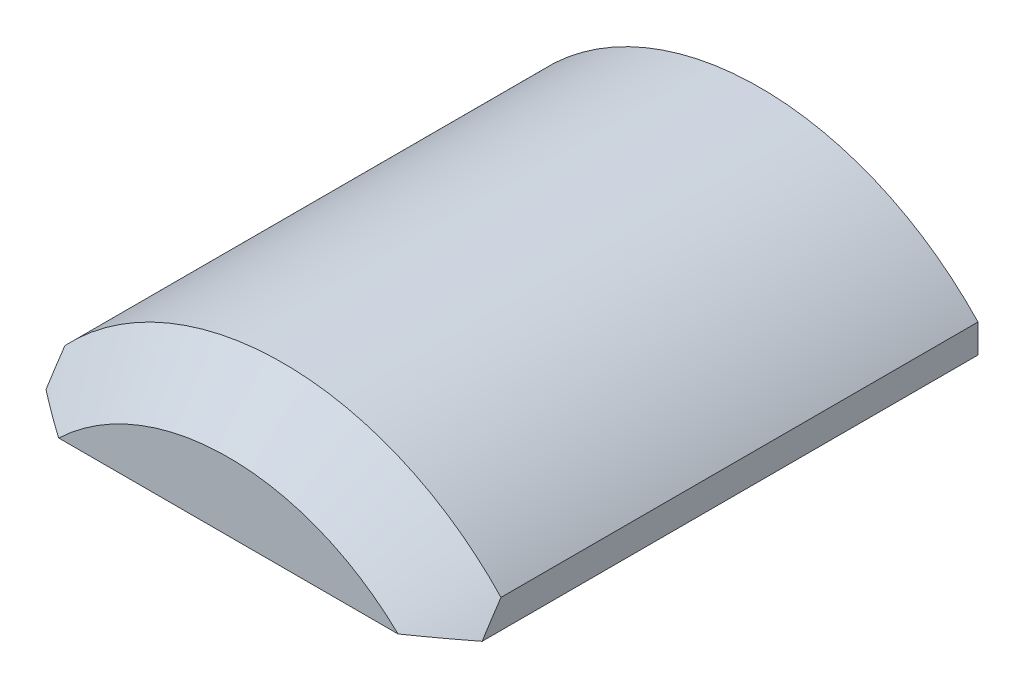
ISO-10303-21;
HEADER;
FILE_DESCRIPTION(('STEP AP214'),'2;1');
FILE_NAME('part.step','',(''),(''),'','','');
FILE_SCHEMA(('AUTOMOTIVE_DESIGN { 1 0 10303 214 1 1 1 1 }'));
ENDSEC;
DATA;
#1=APPLICATION_CONTEXT('core data for automotive mechanical design processes');
#2=APPLICATION_PROTOCOL_DEFINITION('international standard','automotive_design',2000,#1);
#3=PRODUCT_CONTEXT('',#1,'mechanical');
#4=PRODUCT('Part','Part','',(#3));
#5=PRODUCT_RELATED_PRODUCT_CATEGORY('part','',(#4));
#6=PRODUCT_DEFINITION_FORMATION('','',#4);
#7=PRODUCT_DEFINITION_CONTEXT('part definition',#1,'design');
#8=PRODUCT_DEFINITION('design','',#6,#7);
#9=PRODUCT_DEFINITION_SHAPE('','',#8);
#10=(LENGTH_UNIT() NAMED_UNIT(*) SI_UNIT(.MILLI.,.METRE.));
#11=(NAMED_UNIT(*) PLANE_ANGLE_UNIT() SI_UNIT($,.RADIAN.));
#12=(NAMED_UNIT(*) SI_UNIT($,.STERADIAN.) SOLID_ANGLE_UNIT());
#13=UNCERTAINTY_MEASURE_WITH_UNIT(LENGTH_MEASURE(1.E-05),#10,'distance_accuracy_value','');
#14=(GEOMETRIC_REPRESENTATION_CONTEXT(3) GLOBAL_UNCERTAINTY_ASSIGNED_CONTEXT((#13)) GLOBAL_UNIT_ASSIGNED_CONTEXT((#10,
#11,#12)) REPRESENTATION_CONTEXT('',''));
#15=CARTESIAN_POINT('',(0.,0.,0.));
#16=DIRECTION('',(0.,0.,1.));
#17=DIRECTION('',(1.,0.,0.));
#18=AXIS2_PLACEMENT_3D('',#15,#16,#17);
#19=CARTESIAN_POINT('',(0.,0.,247.65));
#20=DIRECTION('',(0.,0.,-1.));
#21=DIRECTION('',(-1.,0.,0.));
#22=AXIS2_PLACEMENT_3D('',#19,#20,#21);
#23=CYLINDRICAL_SURFACE('',#22,139.7);
#24=DIRECTION('',(0.,0.,-1.));
#25=VECTOR('',#24,1.);
#26=CARTESIAN_POINT('',(-101.6,95.8828973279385,247.65));
#27=LINE('',#26,#25);
#28=CARTESIAN_POINT('',(-101.6,95.8828973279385,222.25));
#29=VERTEX_POINT('',#28);
#30=CARTESIAN_POINT('',(-101.6,95.8828973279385,0.));
#31=VERTEX_POINT('',#30);
#32=EDGE_CURVE('E84',#29,#31,#27,.T.);
#33=ORIENTED_EDGE('',*,*,#32,.F.);
#34=CARTESIAN_POINT('',(0.,0.,222.25));
#35=DIRECTION('',(0.,0.,1.));
#36=DIRECTION('',(1.,0.,0.));
#37=AXIS2_PLACEMENT_3D('',#34,#35,#36);
#38=CIRCLE('',#37,139.7);
#39=CARTESIAN_POINT('',(101.6,95.8828973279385,222.25));
#40=VERTEX_POINT('',#39);
#41=EDGE_CURVE('E48',#29,#40,#38,.F.);
#42=ORIENTED_EDGE('',*,*,#41,.T.);
#43=DIRECTION('',(0.,0.,-1.));
#44=VECTOR('',#43,1.);
#45=CARTESIAN_POINT('',(101.6,95.8828973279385,247.65));
#46=LINE('',#45,#44);
#47=CARTESIAN_POINT('',(101.6,95.8828973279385,0.));
#48=VERTEX_POINT('',#47);
#49=EDGE_CURVE('E101',#40,#48,#46,.T.);
#50=ORIENTED_EDGE('',*,*,#49,.T.);
#51=CARTESIAN_POINT('',(0.,0.,0.));
#52=DIRECTION('',(0.,0.,1.));
#53=DIRECTION('',(1.,0.,0.));
#54=AXIS2_PLACEMENT_3D('',#51,#52,#53);
#55=CIRCLE('',#54,139.7);
#56=EDGE_CURVE('E97',#48,#31,#55,.T.);
#57=ORIENTED_EDGE('',*,*,#56,.T.);
#58=EDGE_LOOP('',(#33,#42,#50,#57));
#59=FACE_BOUND('',#58,.T.);
#60=ADVANCED_FACE('F35',(#59),#23,.T.);
#61=CARTESIAN_POINT('',(-101.6,82.55,247.65));
#62=DIRECTION('',(1.,0.,0.));
#63=DIRECTION('',(0.,1.,0.));
#64=AXIS2_PLACEMENT_3D('',#61,#62,#63);
#65=PLANE('',#64);
#66=DIRECTION('',(0.,0.,-1.));
#67=VECTOR('',#66,1.);
#68=CARTESIAN_POINT('',(-101.6,82.55,247.65));
#69=LINE('',#68,#67);
#70=CARTESIAN_POINT('',(-101.6,82.55,231.041396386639));
#71=VERTEX_POINT('',#70);
#72=CARTESIAN_POINT('',(-101.6,82.55,0.));
#73=VERTEX_POINT('',#72);
#74=EDGE_CURVE('E91',#71,#73,#69,.T.);
#75=ORIENTED_EDGE('',*,*,#74,.F.);
#76=CARTESIAN_POINT('',(-101.6,82.55,231.041396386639));
#77=CARTESIAN_POINT('',(-101.6,83.6758641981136,230.331419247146));
#78=CARTESIAN_POINT('',(-101.6,84.797786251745,229.615210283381));
#79=CARTESIAN_POINT('',(-101.6,87.0340324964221,228.171253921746));
#80=CARTESIAN_POINT('',(-101.6,88.1483573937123,227.443507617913));
#81=CARTESIAN_POINT('',(-101.6,90.3698975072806,225.977274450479));
#82=CARTESIAN_POINT('',(-101.6,91.4771127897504,225.238787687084));
#83=CARTESIAN_POINT('',(-101.6,93.6849132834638,223.751743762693));
#84=CARTESIAN_POINT('',(-101.6,94.7854978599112,223.00318565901));
#85=CARTESIAN_POINT('',(-101.6,95.8828973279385,222.25));
#86=B_SPLINE_CURVE_WITH_KNOTS('',3,(#76,#77,#78,#79,#80,#81,#82,#83,#84,#85),.UNSPECIFIED.,.F.,
.F.,(4,2,2,2,4),(0.,3.99305105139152,7.98572569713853,11.9783631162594,15.9713768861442),.UNSPECIFIED.);
#87=EDGE_CURVE('E62',#71,#29,#86,.T.);
#88=ORIENTED_EDGE('',*,*,#87,.T.);
#89=ORIENTED_EDGE('',*,*,#32,.T.);
#90=DIRECTION('',(0.,-1.,0.));
#91=VECTOR('',#90,1.);
#92=CARTESIAN_POINT('',(-101.6,82.55,0.));
#93=LINE('',#92,#91);
#94=EDGE_CURVE('E87',#31,#73,#93,.T.);
#95=ORIENTED_EDGE('',*,*,#94,.T.);
#96=EDGE_LOOP('',(#75,#88,#89,#95));
#97=FACE_BOUND('',#96,.T.);
#98=ADVANCED_FACE('F86',(#97),#65,.F.);
#99=CARTESIAN_POINT('',(101.6,82.55,247.65));
#100=DIRECTION('',(0.,1.,0.));
#101=DIRECTION('',(-1.,0.,0.));
#102=AXIS2_PLACEMENT_3D('',#99,#100,#101);
#103=PLANE('',#102);
#104=DIRECTION('',(1.,0.,0.));
#105=VECTOR('',#104,1.);
#106=CARTESIAN_POINT('',(101.6,82.55,247.65));
#107=LINE('',#106,#105);
#108=CARTESIAN_POINT('',(-79.0568624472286,82.55,247.65));
#109=VERTEX_POINT('',#108);
#110=CARTESIAN_POINT('',(79.0568624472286,82.55,247.65));
#111=VERTEX_POINT('',#110);
#112=EDGE_CURVE('E105',#109,#111,#107,.T.);
#113=ORIENTED_EDGE('',*,*,#112,.F.);
#114=CARTESIAN_POINT('',(-79.0568624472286,82.55,247.65));
#115=CARTESIAN_POINT('',(-80.0166359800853,82.55,246.986152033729));
#116=CARTESIAN_POINT('',(-80.9734615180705,82.55,246.318058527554));
#117=CARTESIAN_POINT('',(-82.8815320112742,82.55,244.973968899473));
#118=CARTESIAN_POINT('',(-83.8327770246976,82.55,244.297972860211));
#119=CARTESIAN_POINT('',(-86.6782846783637,82.55,242.259250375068));
#120=CARTESIAN_POINT('',(-88.5646835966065,82.55,240.885537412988));
#121=CARTESIAN_POINT('',(-92.318680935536,82.55,238.112846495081));
#122=CARTESIAN_POINT('',(-94.1862800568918,82.55,236.713869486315));
#123=CARTESIAN_POINT('',(-96.9752948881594,82.55,234.598739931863));
#124=CARTESIAN_POINT('',(-97.9029912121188,82.55,233.890850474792));
#125=CARTESIAN_POINT('',(-99.7544148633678,82.55,232.46990945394));
#126=CARTESIAN_POINT('',(-100.678142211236,82.55,231.756857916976));
#127=CARTESIAN_POINT('',(-101.6,82.55,231.041396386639));
#128=B_SPLINE_CURVE_WITH_KNOTS('',3,(#114,#115,#116,#117,#118,#119,#120,#121,#122,#123,#124,
#125,#126,#127),.UNSPECIFIED.,.F.,.F.,(4,2,2,2,2,2,4),(0.,3.50093489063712,7.00183320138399,
14.0023023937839,21.0025097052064,24.5032872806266,28.0040466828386),.UNSPECIFIED.);
#129=EDGE_CURVE('E122',#109,#71,#128,.T.);
#130=ORIENTED_EDGE('',*,*,#129,.T.);
#131=ORIENTED_EDGE('',*,*,#74,.T.);
#132=DIRECTION('',(1.,0.,0.));
#133=VECTOR('',#132,1.);
#134=CARTESIAN_POINT('',(101.6,82.55,0.));
#135=LINE('',#134,#133);
#136=CARTESIAN_POINT('',(101.6,82.55,0.));
#137=VERTEX_POINT('',#136);
#138=EDGE_CURVE('E99',#73,#137,#135,.T.);
#139=ORIENTED_EDGE('',*,*,#138,.T.);
#140=DIRECTION('',(0.,0.,-1.));
#141=VECTOR('',#140,1.);
#142=CARTESIAN_POINT('',(101.6,82.55,247.65));
#143=LINE('',#142,#141);
#144=CARTESIAN_POINT('',(101.6,82.55,231.041396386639));
#145=VERTEX_POINT('',#144);
#146=EDGE_CURVE('E111',#145,#137,#143,.T.);
#147=ORIENTED_EDGE('',*,*,#146,.F.);
#148=CARTESIAN_POINT('',(101.6,82.55,231.041396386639));
#149=CARTESIAN_POINT('',(100.678142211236,82.55,231.756857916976));
#150=CARTESIAN_POINT('',(99.7544148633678,82.55,232.46990945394));
#151=CARTESIAN_POINT('',(97.9029912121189,82.55,233.890850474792));
#152=CARTESIAN_POINT('',(96.9752948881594,82.55,234.598739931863));
#153=CARTESIAN_POINT('',(94.1862800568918,82.55,236.713869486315));
#154=CARTESIAN_POINT('',(92.318680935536,82.55,238.112846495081));
#155=CARTESIAN_POINT('',(88.5646835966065,82.55,240.885537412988));
#156=CARTESIAN_POINT('',(86.6782846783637,82.55,242.259250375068));
#157=CARTESIAN_POINT('',(83.8327770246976,82.55,244.297972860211));
#158=CARTESIAN_POINT('',(82.8815320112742,82.55,244.973968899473));
#159=CARTESIAN_POINT('',(80.9734615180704,82.55,246.318058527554));
#160=CARTESIAN_POINT('',(80.0166359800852,82.55,246.986152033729));
#161=CARTESIAN_POINT('',(79.0568624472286,82.55,247.65));
#162=B_SPLINE_CURVE_WITH_KNOTS('',3,(#148,#149,#150,#151,#152,#153,#154,#155,#156,#157,#158,
#159,#160,#161),.UNSPECIFIED.,.F.,.F.,(4,2,2,2,2,2,4),(0.,3.500759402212,7.0015369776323,
14.0017442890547,21.0022134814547,24.5031117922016,28.0040466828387),.UNSPECIFIED.);
#163=EDGE_CURVE('E116',#145,#111,#162,.T.);
#164=ORIENTED_EDGE('',*,*,#163,.T.);
#165=EDGE_LOOP('',(#113,#130,#131,#139,#147,#164));
#166=FACE_BOUND('',#165,.T.);
#167=ADVANCED_FACE('F127',(#166),#103,.F.);
#168=CARTESIAN_POINT('',(101.6,95.8828973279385,247.65));
#169=DIRECTION('',(-1.,0.,0.));
#170=DIRECTION('',(0.,0.,1.));
#171=AXIS2_PLACEMENT_3D('',#168,#169,#170);
#172=PLANE('',#171);
#173=ORIENTED_EDGE('',*,*,#49,.F.);
#174=CARTESIAN_POINT('',(101.6,95.8828973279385,222.25));
#175=CARTESIAN_POINT('',(101.6,94.7854978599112,223.00318565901));
#176=CARTESIAN_POINT('',(101.6,93.6849132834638,223.751743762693));
#177=CARTESIAN_POINT('',(101.6,91.4771127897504,225.238787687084));
#178=CARTESIAN_POINT('',(101.6,90.3698975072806,225.977274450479));
#179=CARTESIAN_POINT('',(101.6,88.1483573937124,227.443507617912));
#180=CARTESIAN_POINT('',(101.6,87.0340324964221,228.171253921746));
#181=CARTESIAN_POINT('',(101.6,84.797786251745,229.615210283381));
#182=CARTESIAN_POINT('',(101.6,83.6758641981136,230.331419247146));
#183=CARTESIAN_POINT('',(101.6,82.55,231.041396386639));
#184=B_SPLINE_CURVE_WITH_KNOTS('',3,(#174,#175,#176,#177,#178,#179,#180,#181,#182,#183),
.UNSPECIFIED.,.F.,.F.,(4,2,2,2,4),(0.,3.99301376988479,7.9856511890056,11.9783258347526,
15.9713768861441),.UNSPECIFIED.);
#185=EDGE_CURVE('E11',#40,#145,#184,.T.);
#186=ORIENTED_EDGE('',*,*,#185,.T.);
#187=ORIENTED_EDGE('',*,*,#146,.T.);
#188=DIRECTION('',(0.,1.,0.));
#189=VECTOR('',#188,1.);
#190=CARTESIAN_POINT('',(101.6,95.8828973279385,0.));
#191=LINE('',#190,#189);
#192=EDGE_CURVE('E108',#137,#48,#191,.T.);
#193=ORIENTED_EDGE('',*,*,#192,.T.);
#194=EDGE_LOOP('',(#173,#186,#187,#193));
#195=FACE_BOUND('',#194,.T.);
#196=ADVANCED_FACE('F131',(#195),#172,.F.);
#197=CARTESIAN_POINT('',(0.,0.,247.65));
#198=DIRECTION('',(0.,0.,1.));
#199=DIRECTION('',(1.,0.,0.));
#200=AXIS2_PLACEMENT_3D('',#197,#198,#199);
#201=PLANE('',#200);
#202=ORIENTED_EDGE('',*,*,#112,.T.);
#203=CARTESIAN_POINT('',(0.,0.,247.65));
#204=DIRECTION('',(0.,0.,1.));
#205=DIRECTION('',(1.,0.,0.));
#206=AXIS2_PLACEMENT_3D('',#203,#204,#205);
#207=CIRCLE('',#206,114.3);
#208=EDGE_CURVE('E90',#111,#109,#207,.T.);
#209=ORIENTED_EDGE('',*,*,#208,.T.);
#210=EDGE_LOOP('',(#202,#209));
#211=FACE_BOUND('',#210,.T.);
#212=ADVANCED_FACE('F150',(#211),#201,.T.);
#213=CARTESIAN_POINT('',(0.,0.,0.));
#214=DIRECTION('',(0.,0.,1.));
#215=DIRECTION('',(1.,0.,0.));
#216=AXIS2_PLACEMENT_3D('',#213,#214,#215);
#217=PLANE('',#216);
#218=ORIENTED_EDGE('',*,*,#56,.F.);
#219=ORIENTED_EDGE('',*,*,#192,.F.);
#220=ORIENTED_EDGE('',*,*,#138,.F.);
#221=ORIENTED_EDGE('',*,*,#94,.F.);
#222=EDGE_LOOP('',(#218,#219,#220,#221));
#223=FACE_BOUND('',#222,.T.);
#224=ADVANCED_FACE('F95',(#223),#217,.F.);
#225=CARTESIAN_POINT('',(0.,0.,247.65));
#226=DIRECTION('',(0.,0.,-1.));
#227=DIRECTION('',(-1.,0.,0.));
#228=AXIS2_PLACEMENT_3D('',#225,#226,#227);
#229=CONICAL_SURFACE('',#228,114.3,0.785398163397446);
#230=ORIENTED_EDGE('',*,*,#185,.F.);
#231=ORIENTED_EDGE('',*,*,#41,.F.);
#232=ORIENTED_EDGE('',*,*,#87,.F.);
#233=ORIENTED_EDGE('',*,*,#129,.F.);
#234=ORIENTED_EDGE('',*,*,#208,.F.);
#235=ORIENTED_EDGE('',*,*,#163,.F.);
#236=EDGE_LOOP('',(#230,#231,#232,#233,#234,#235));
#237=FACE_BOUND('',#236,.T.);
#238=ADVANCED_FACE('F37',(#237),#229,.T.);
#239=CLOSED_SHELL('',(#60,#98,#167,#196,#212,#224,#238));
#240=MANIFOLD_SOLID_BREP('B2',#239);
#241=ADVANCED_BREP_SHAPE_REPRESENTATION('',(#18,#240),#14);
#242=SHAPE_DEFINITION_REPRESENTATION(#9,#241);
ENDSEC;
END-ISO-10303-21;
